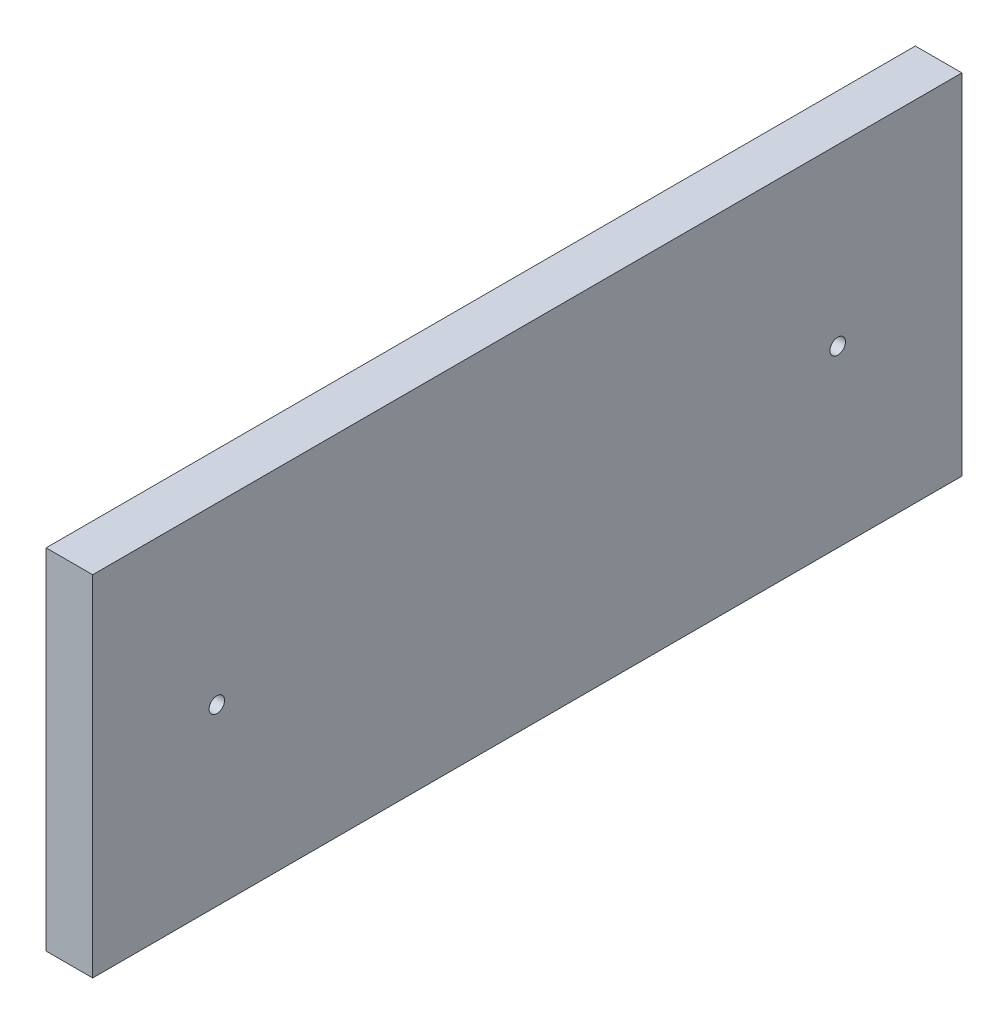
from build123d import *

# Parameters (mm, degrees)
SKETCH2_W           = 38.1
SKETCH2_H           = 285.75
BOSS_EXTRUDE1_DEPTH = 711.2
SKETCH3_R           = 6.35
CUT_EXTRUDE1_DEPTH  = 768.404790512


with BuildPart() as part:
    # Sketch2 → Boss-Extrude1 (new body)
    with BuildSketch(Plane.XY):
        with Locations((19.05, 142.875)):
            Rectangle(SKETCH2_W, SKETCH2_H)
    extrude(amount=BOSS_EXTRUDE1_DEPTH)

    # Sketch3 → Cut-Extrude1 (cut, through all)
    with BuildSketch(Plane(origin=(38.1, 0, 0), x_dir=(0, 0, -1), z_dir=(1, 0, 0))):
        with Locations((-609.6, 142.875)):
            Circle(SKETCH3_R)
        with Locations((-101.6, 142.875)):
            Circle(SKETCH3_R)
    extrude(amount=-CUT_EXTRUDE1_DEPTH, mode=Mode.SUBTRACT)


solid = part.part
